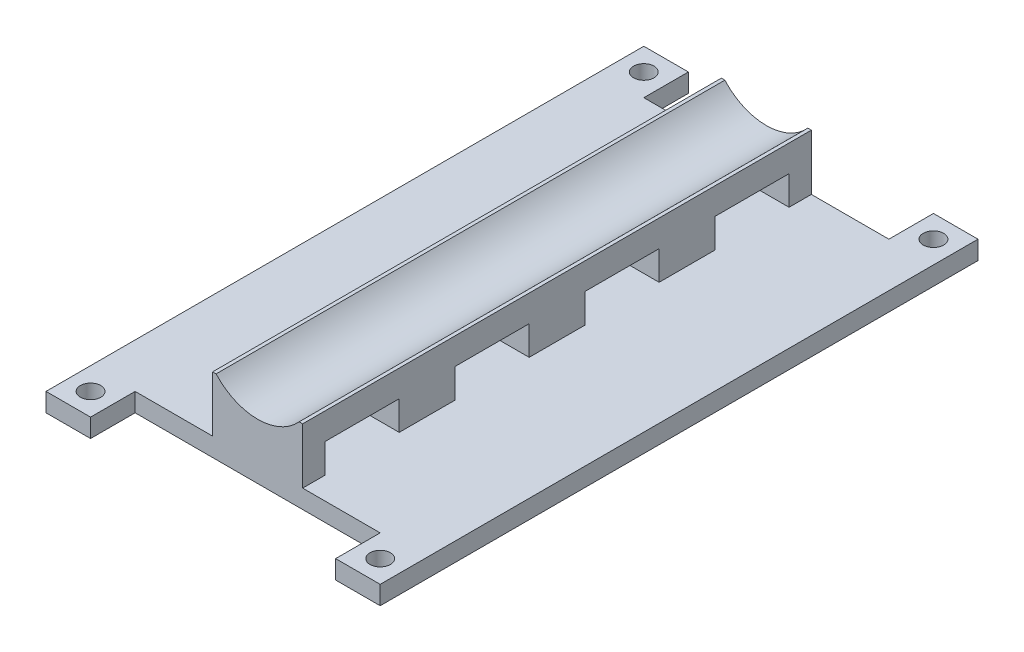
from build123d import *

# Parameters (mm, degrees)
SKETCH2_R           = 2.75
BOSS_EXTRUDE1_DEPTH = 5
BOSS_EXTRUDE2_DEPTH = 137
SKETCH6_W           = 20
SKETCH6_H           = 4
SKETCH7_W           = 20
SKETCH7_H           = 3.136166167
CUT_EXTRUDE1_DEPTH  = 173.000185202
LPATTERN1_COUNT     = 4
LPATTERN1_PITCH     = 35


with BuildPart() as part:
    # Sketch2 → Boss-Extrude1 (new body)
    with BuildSketch(Plane(origin=(0, 0, 0), x_dir=(1, 0, 0), z_dir=(0, 1, 0))):
        Polygon((0, 0), (12, 0), (12, 12), (78, 12), (78, 0), (90, 0), (90, 161), (78, 161), (78, 149), (12, 149), (12, 161), (0, 161), align=None)
        with Locations(Location((6, 155, 0), (0, 0, 270))):
            Circle(SKETCH2_R, mode=Mode.SUBTRACT)
        with Locations(Location((84, 155, 0), (0, 0, 270))):
            Circle(SKETCH2_R, mode=Mode.SUBTRACT)
        with Locations(Location((84, 6, 0), (0, 0, 270))):
            Circle(SKETCH2_R, mode=Mode.SUBTRACT)
        with Locations(Location((6, 6, 0), (0, 0, 270))):
            Circle(SKETCH2_R, mode=Mode.SUBTRACT)
    extrude(amount=BOSS_EXTRUDE1_DEPTH)

    # Sketch3 → Boss-Extrude2 (add)
    with BuildSketch(Plane.XY.offset(-12)):
        with BuildLine():
            Line((32.87676734, 5), (57.12323266, 5))
            Line((57.12323266, 5), (57.12323266, 20))
            Line((57.12323266, 20), (56.180339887, 20))
            ThreePointArc((56.180339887, 20), (45, 15), (33.819660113, 20))
            Line((33.819660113, 20), (32.87676734, 20))
            Line((32.87676734, 20), (32.87676734, 5))
        make_face()
    extrude(amount=-BOSS_EXTRUDE2_DEPTH)

    # Sketch6 → Cut-Revolve1 (revolve, cut)
    with BuildSketch(Plane(origin=(45, 0, 0), x_dir=(0, 0, -1), z_dir=(1, 0, 0))):
        with Locations((28, 7)):
            Rectangle(SKETCH6_W, SKETCH6_H)
    cut_revolve1 = revolve(axis=Axis((45, 30, -12), (0, 0, -1)), mode=Mode.SUBTRACT)

    # Sketch7 → Cut-Extrude1 (cut, through all)
    with BuildSketch(Plane(origin=(57.12323266, 0, 0), x_dir=(0, 0, -1), z_dir=(1, 0, 0))):
        with Locations((28, 6.568083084)):
            Rectangle(SKETCH7_W, SKETCH7_H)
    cut_extrude1 = extrude(amount=-CUT_EXTRUDE1_DEPTH, mode=Mode.SUBTRACT)

    # LPattern1: Cut-Revolve1, Cut-Extrude1 ×4
    with Locations(*[(0, 0, -i * LPATTERN1_PITCH) for i in range(1, LPATTERN1_COUNT)]):
        add(cut_revolve1, mode=Mode.SUBTRACT)
        add(cut_extrude1, mode=Mode.SUBTRACT)


solid = part.part
